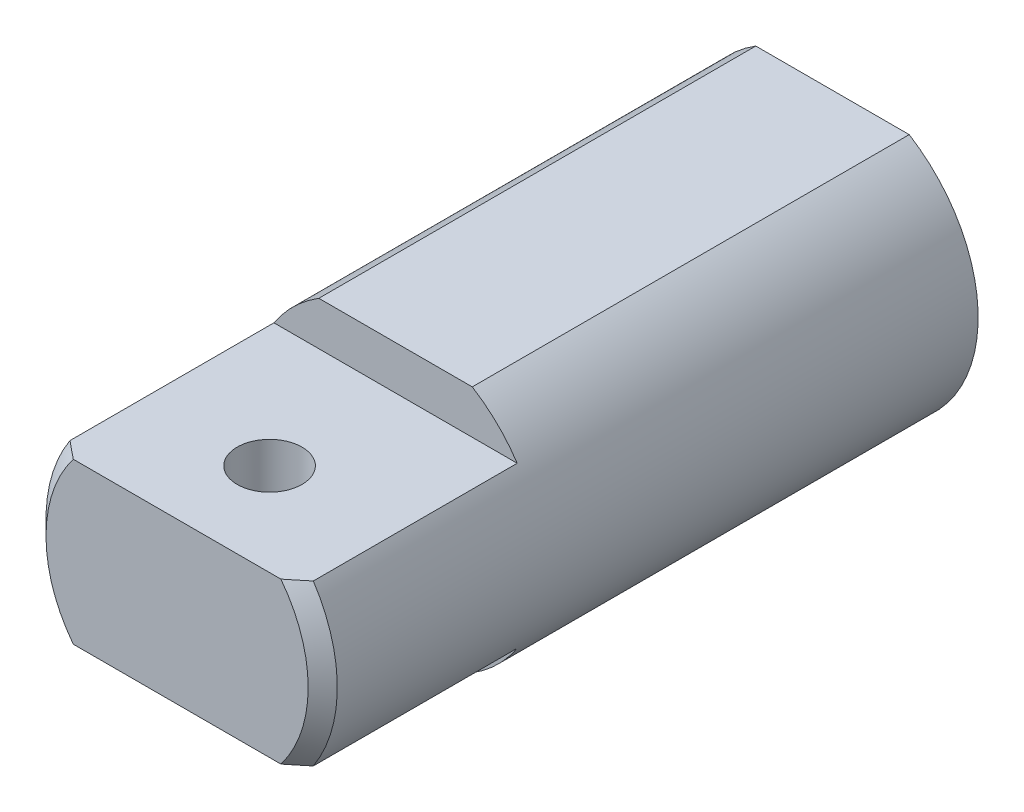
ISO-10303-21;
HEADER;
FILE_DESCRIPTION(('STEP AP214'),'2;1');
FILE_NAME('part.step','',(''),(''),'','','');
FILE_SCHEMA(('AUTOMOTIVE_DESIGN { 1 0 10303 214 1 1 1 1 }'));
ENDSEC;
DATA;
#1=APPLICATION_CONTEXT('core data for automotive mechanical design processes');
#2=APPLICATION_PROTOCOL_DEFINITION('international standard','automotive_design',2000,#1);
#3=PRODUCT_CONTEXT('',#1,'mechanical');
#4=PRODUCT('Part','Part','',(#3));
#5=PRODUCT_RELATED_PRODUCT_CATEGORY('part','',(#4));
#6=PRODUCT_DEFINITION_FORMATION('','',#4);
#7=PRODUCT_DEFINITION_CONTEXT('part definition',#1,'design');
#8=PRODUCT_DEFINITION('design','',#6,#7);
#9=PRODUCT_DEFINITION_SHAPE('','',#8);
#10=(LENGTH_UNIT() NAMED_UNIT(*) SI_UNIT(.MILLI.,.METRE.));
#11=(NAMED_UNIT(*) PLANE_ANGLE_UNIT() SI_UNIT($,.RADIAN.));
#12=(NAMED_UNIT(*) SI_UNIT($,.STERADIAN.) SOLID_ANGLE_UNIT());
#13=UNCERTAINTY_MEASURE_WITH_UNIT(LENGTH_MEASURE(1.E-05),#10,'distance_accuracy_value','');
#14=(GEOMETRIC_REPRESENTATION_CONTEXT(3) GLOBAL_UNCERTAINTY_ASSIGNED_CONTEXT((#13)) GLOBAL_UNIT_ASSIGNED_CONTEXT((#10,
#11,#12)) REPRESENTATION_CONTEXT('',''));
#15=CARTESIAN_POINT('',(0.,0.,0.));
#16=DIRECTION('',(0.,0.,1.));
#17=DIRECTION('',(1.,0.,0.));
#18=AXIS2_PLACEMENT_3D('',#15,#16,#17);
#19=CARTESIAN_POINT('',(308.084985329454,-199.999999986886,281.45));
#20=DIRECTION('',(0.,1.,0.));
#21=DIRECTION('',(1.,0.,0.));
#22=AXIS2_PLACEMENT_3D('',#19,#20,#21);
#23=CYLINDRICAL_SURFACE('',#22,2.22500000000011);
#24=CARTESIAN_POINT('',(308.084985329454,-205.499999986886,281.45));
#25=DIRECTION('',(0.,-1.,0.));
#26=DIRECTION('',(0.,0.,-1.));
#27=AXIS2_PLACEMENT_3D('',#24,#25,#26);
#28=CIRCLE('',#27,2.22500000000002);
#29=CARTESIAN_POINT('',(308.084985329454,-205.499999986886,279.225));
#30=VERTEX_POINT('',#29);
#31=EDGE_CURVE('E11',#30,#30,#28,.T.);
#32=ORIENTED_EDGE('',*,*,#31,.T.);
#33=EDGE_LOOP('',(#32));
#34=FACE_BOUND('',#33,.T.);
#35=CARTESIAN_POINT('',(308.084985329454,-194.499999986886,281.45));
#36=DIRECTION('',(0.,1.,0.));
#37=DIRECTION('',(1.,0.,0.));
#38=AXIS2_PLACEMENT_3D('',#35,#36,#37);
#39=CIRCLE('',#38,2.22500000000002);
#40=CARTESIAN_POINT('',(310.309985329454,-194.499999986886,281.45));
#41=VERTEX_POINT('',#40);
#42=EDGE_CURVE('E25',#41,#41,#39,.T.);
#43=ORIENTED_EDGE('',*,*,#42,.T.);
#44=EDGE_LOOP('',(#43));
#45=FACE_BOUND('',#44,.T.);
#46=ADVANCED_FACE('F16',(#34,#45),#23,.F.);
#47=CARTESIAN_POINT('',(308.084985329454,-199.999999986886,264.3));
#48=DIRECTION('',(0.,0.,-1.));
#49=DIRECTION('',(0.,-1.,0.));
#50=AXIS2_PLACEMENT_3D('',#47,#48,#49);
#51=CYLINDRICAL_SURFACE('',#50,4.18800000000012);
#52=CARTESIAN_POINT('',(308.084985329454,-199.999999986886,265.8));
#53=DIRECTION('',(0.,0.,-1.));
#54=DIRECTION('',(0.,-1.,0.));
#55=AXIS2_PLACEMENT_3D('',#52,#53,#54);
#56=CIRCLE('',#55,4.18799999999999);
#57=CARTESIAN_POINT('',(308.084985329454,-204.187999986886,265.8));
#58=VERTEX_POINT('',#57);
#59=EDGE_CURVE('E284',#58,#58,#56,.T.);
#60=ORIENTED_EDGE('',*,*,#59,.F.);
#61=EDGE_LOOP('',(#60));
#62=FACE_BOUND('',#61,.T.);
#63=CARTESIAN_POINT('',(308.084985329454,-199.999999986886,262.8));
#64=DIRECTION('',(0.,0.,-1.));
#65=DIRECTION('',(0.,-1.,0.));
#66=AXIS2_PLACEMENT_3D('',#63,#64,#65);
#67=CIRCLE('',#66,4.188);
#68=CARTESIAN_POINT('',(308.084985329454,-204.187999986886,262.8));
#69=VERTEX_POINT('',#68);
#70=EDGE_CURVE('E287',#69,#69,#67,.T.);
#71=ORIENTED_EDGE('',*,*,#70,.T.);
#72=EDGE_LOOP('',(#71));
#73=FACE_BOUND('',#72,.T.);
#74=ADVANCED_FACE('F313',(#62,#73),#51,.F.);
#75=CARTESIAN_POINT('',(308.084985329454,-199.999999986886,266.051640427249));
#76=DIRECTION('',(0.,0.,-1.));
#77=DIRECTION('',(1.,0.,0.));
#78=AXIS2_PLACEMENT_3D('',#75,#76,#77);
#79=CONICAL_SURFACE('',#78,3.76919999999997,1.02974425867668);
#80=CARTESIAN_POINT('',(308.084985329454,-199.999999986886,268.316404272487));
#81=VERTEX_POINT('',#80);
#82=VERTEX_LOOP('',#81);
#83=FACE_BOUND('',#82,.T.);
#84=ORIENTED_EDGE('',*,*,#59,.T.);
#85=EDGE_LOOP('',(#84));
#86=FACE_BOUND('',#85,.T.);
#87=ADVANCED_FACE('F319',(#83,#86),#79,.F.);
#88=CARTESIAN_POINT('',(308.084985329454,-199.999999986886,242.875));
#89=DIRECTION('',(0.,0.,-1.));
#90=DIRECTION('',(1.,0.,0.));
#91=AXIS2_PLACEMENT_3D('',#88,#89,#90);
#92=CONICAL_SURFACE('',#91,4.91879999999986,0.825070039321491);
#93=CARTESIAN_POINT('',(308.084985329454,-199.999999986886,243.55));
#94=DIRECTION('',(0.,0.,-1.));
#95=DIRECTION('',(0.,-1.,0.));
#96=AXIS2_PLACEMENT_3D('',#93,#94,#95);
#97=CIRCLE('',#96,4.18799999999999);
#98=CARTESIAN_POINT('',(308.084985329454,-204.187999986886,243.55));
#99=VERTEX_POINT('',#98);
#100=EDGE_CURVE('E275',#99,#99,#97,.T.);
#101=ORIENTED_EDGE('',*,*,#100,.F.);
#102=EDGE_LOOP('',(#101));
#103=FACE_BOUND('',#102,.T.);
#104=CARTESIAN_POINT('',(308.084985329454,-199.999999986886,242.8));
#105=DIRECTION('',(0.,0.,-1.));
#106=DIRECTION('',(0.,-1.,0.));
#107=AXIS2_PLACEMENT_3D('',#104,#105,#106);
#108=CIRCLE('',#107,5.);
#109=CARTESIAN_POINT('',(308.084985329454,-204.999999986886,242.8));
#110=VERTEX_POINT('',#109);
#111=EDGE_CURVE('E281',#110,#110,#108,.T.);
#112=ORIENTED_EDGE('',*,*,#111,.T.);
#113=EDGE_LOOP('',(#112));
#114=FACE_BOUND('',#113,.T.);
#115=ADVANCED_FACE('F329',(#103,#114),#92,.F.);
#116=CARTESIAN_POINT('',(308.084985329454,-199.999999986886,243.625));
#117=DIRECTION('',(0.,0.,1.));
#118=DIRECTION('',(1.,0.,0.));
#119=AXIS2_PLACEMENT_3D('',#116,#117,#118);
#120=CONICAL_SURFACE('',#119,4.26919999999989,0.825070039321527);
#121=CARTESIAN_POINT('',(308.084985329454,-199.999999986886,244.3));
#122=DIRECTION('',(0.,0.,1.));
#123=DIRECTION('',(1.,0.,0.));
#124=AXIS2_PLACEMENT_3D('',#121,#122,#123);
#125=CIRCLE('',#124,5.);
#126=CARTESIAN_POINT('',(313.084985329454,-199.999999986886,244.3));
#127=VERTEX_POINT('',#126);
#128=EDGE_CURVE('E278',#127,#127,#125,.T.);
#129=ORIENTED_EDGE('',*,*,#128,.T.);
#130=EDGE_LOOP('',(#129));
#131=FACE_BOUND('',#130,.T.);
#132=ORIENTED_EDGE('',*,*,#100,.T.);
#133=EDGE_LOOP('',(#132));
#134=FACE_BOUND('',#133,.T.);
#135=ADVANCED_FACE('F325',(#131,#134),#120,.F.);
#136=CARTESIAN_POINT('',(308.084985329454,-199.999999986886,244.375));
#137=DIRECTION('',(0.,0.,-1.));
#138=DIRECTION('',(1.,0.,0.));
#139=AXIS2_PLACEMENT_3D('',#136,#137,#138);
#140=CONICAL_SURFACE('',#139,4.91879999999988,0.825070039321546);
#141=CARTESIAN_POINT('',(308.084985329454,-199.999999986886,245.05));
#142=DIRECTION('',(0.,0.,-1.));
#143=DIRECTION('',(0.,-1.,0.));
#144=AXIS2_PLACEMENT_3D('',#141,#142,#143);
#145=CIRCLE('',#144,4.18799999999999);
#146=CARTESIAN_POINT('',(308.084985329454,-204.187999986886,245.05));
#147=VERTEX_POINT('',#146);
#148=EDGE_CURVE('E269',#147,#147,#145,.T.);
#149=ORIENTED_EDGE('',*,*,#148,.F.);
#150=EDGE_LOOP('',(#149));
#151=FACE_BOUND('',#150,.T.);
#152=ORIENTED_EDGE('',*,*,#128,.F.);
#153=EDGE_LOOP('',(#152));
#154=FACE_BOUND('',#153,.T.);
#155=ADVANCED_FACE('F328',(#151,#154),#140,.F.);
#156=CARTESIAN_POINT('',(308.084985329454,-199.999999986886,245.125));
#157=DIRECTION('',(0.,0.,1.));
#158=DIRECTION('',(1.,0.,0.));
#159=AXIS2_PLACEMENT_3D('',#156,#157,#158);
#160=CONICAL_SURFACE('',#159,4.26919999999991,0.825070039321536);
#161=CARTESIAN_POINT('',(308.084985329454,-199.999999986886,245.8));
#162=DIRECTION('',(0.,0.,1.));
#163=DIRECTION('',(1.,0.,0.));
#164=AXIS2_PLACEMENT_3D('',#161,#162,#163);
#165=CIRCLE('',#164,5.);
#166=CARTESIAN_POINT('',(313.084985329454,-199.999999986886,245.8));
#167=VERTEX_POINT('',#166);
#168=EDGE_CURVE('E272',#167,#167,#165,.T.);
#169=ORIENTED_EDGE('',*,*,#168,.T.);
#170=EDGE_LOOP('',(#169));
#171=FACE_BOUND('',#170,.T.);
#172=ORIENTED_EDGE('',*,*,#148,.T.);
#173=EDGE_LOOP('',(#172));
#174=FACE_BOUND('',#173,.T.);
#175=ADVANCED_FACE('F331',(#171,#174),#160,.F.);
#176=CARTESIAN_POINT('',(308.084985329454,-199.999999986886,245.875));
#177=DIRECTION('',(0.,0.,-1.));
#178=DIRECTION('',(1.,0.,0.));
#179=AXIS2_PLACEMENT_3D('',#176,#177,#178);
#180=CONICAL_SURFACE('',#179,4.91879999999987,0.825070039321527);
#181=CARTESIAN_POINT('',(308.084985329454,-199.999999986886,246.55));
#182=DIRECTION('',(0.,0.,-1.));
#183=DIRECTION('',(0.,-1.,0.));
#184=AXIS2_PLACEMENT_3D('',#181,#182,#183);
#185=CIRCLE('',#184,4.18799999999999);
#186=CARTESIAN_POINT('',(308.084985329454,-204.187999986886,246.55));
#187=VERTEX_POINT('',#186);
#188=EDGE_CURVE('E263',#187,#187,#185,.T.);
#189=ORIENTED_EDGE('',*,*,#188,.F.);
#190=EDGE_LOOP('',(#189));
#191=FACE_BOUND('',#190,.T.);
#192=ORIENTED_EDGE('',*,*,#168,.F.);
#193=EDGE_LOOP('',(#192));
#194=FACE_BOUND('',#193,.T.);
#195=ADVANCED_FACE('F334',(#191,#194),#180,.F.);
#196=CARTESIAN_POINT('',(308.084985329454,-199.999999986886,246.625));
#197=DIRECTION('',(0.,0.,1.));
#198=DIRECTION('',(1.,0.,0.));
#199=AXIS2_PLACEMENT_3D('',#196,#197,#198);
#200=CONICAL_SURFACE('',#199,4.26919999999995,0.82507003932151);
#201=CARTESIAN_POINT('',(308.084985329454,-199.999999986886,247.3));
#202=DIRECTION('',(0.,0.,1.));
#203=DIRECTION('',(1.,0.,0.));
#204=AXIS2_PLACEMENT_3D('',#201,#202,#203);
#205=CIRCLE('',#204,5.);
#206=CARTESIAN_POINT('',(313.084985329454,-199.999999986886,247.3));
#207=VERTEX_POINT('',#206);
#208=EDGE_CURVE('E266',#207,#207,#205,.T.);
#209=ORIENTED_EDGE('',*,*,#208,.T.);
#210=EDGE_LOOP('',(#209));
#211=FACE_BOUND('',#210,.T.);
#212=ORIENTED_EDGE('',*,*,#188,.T.);
#213=EDGE_LOOP('',(#212));
#214=FACE_BOUND('',#213,.T.);
#215=ADVANCED_FACE('F342',(#211,#214),#200,.F.);
#216=CARTESIAN_POINT('',(308.084985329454,-199.999999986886,247.375));
#217=DIRECTION('',(0.,0.,-1.));
#218=DIRECTION('',(1.,0.,0.));
#219=AXIS2_PLACEMENT_3D('',#216,#217,#218);
#220=CONICAL_SURFACE('',#219,4.91879999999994,0.825070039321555);
#221=CARTESIAN_POINT('',(308.084985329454,-199.999999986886,248.05));
#222=DIRECTION('',(0.,0.,-1.));
#223=DIRECTION('',(0.,-1.,0.));
#224=AXIS2_PLACEMENT_3D('',#221,#222,#223);
#225=CIRCLE('',#224,4.18799999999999);
#226=CARTESIAN_POINT('',(308.084985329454,-204.187999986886,248.05));
#227=VERTEX_POINT('',#226);
#228=EDGE_CURVE('E257',#227,#227,#225,.T.);
#229=ORIENTED_EDGE('',*,*,#228,.F.);
#230=EDGE_LOOP('',(#229));
#231=FACE_BOUND('',#230,.T.);
#232=ORIENTED_EDGE('',*,*,#208,.F.);
#233=EDGE_LOOP('',(#232));
#234=FACE_BOUND('',#233,.T.);
#235=ADVANCED_FACE('F345',(#231,#234),#220,.F.);
#236=CARTESIAN_POINT('',(308.084985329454,-199.999999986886,248.125));
#237=DIRECTION('',(0.,0.,1.));
#238=DIRECTION('',(1.,0.,0.));
#239=AXIS2_PLACEMENT_3D('',#236,#237,#238);
#240=CONICAL_SURFACE('',#239,4.2691999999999,0.825070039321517);
#241=CARTESIAN_POINT('',(308.084985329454,-199.999999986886,248.8));
#242=DIRECTION('',(0.,0.,1.));
#243=DIRECTION('',(1.,0.,0.));
#244=AXIS2_PLACEMENT_3D('',#241,#242,#243);
#245=CIRCLE('',#244,5.);
#246=CARTESIAN_POINT('',(313.084985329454,-199.999999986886,248.8));
#247=VERTEX_POINT('',#246);
#248=EDGE_CURVE('E260',#247,#247,#245,.T.);
#249=ORIENTED_EDGE('',*,*,#248,.T.);
#250=EDGE_LOOP('',(#249));
#251=FACE_BOUND('',#250,.T.);
#252=ORIENTED_EDGE('',*,*,#228,.T.);
#253=EDGE_LOOP('',(#252));
#254=FACE_BOUND('',#253,.T.);
#255=ADVANCED_FACE('F349',(#251,#254),#240,.F.);
#256=CARTESIAN_POINT('',(308.084985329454,-199.999999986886,248.875));
#257=DIRECTION('',(0.,0.,-1.));
#258=DIRECTION('',(1.,0.,0.));
#259=AXIS2_PLACEMENT_3D('',#256,#257,#258);
#260=CONICAL_SURFACE('',#259,4.9187999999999,0.825070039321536);
#261=CARTESIAN_POINT('',(308.084985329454,-199.999999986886,249.55));
#262=DIRECTION('',(0.,0.,-1.));
#263=DIRECTION('',(0.,-1.,0.));
#264=AXIS2_PLACEMENT_3D('',#261,#262,#263);
#265=CIRCLE('',#264,4.18799999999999);
#266=CARTESIAN_POINT('',(308.084985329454,-204.187999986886,249.55));
#267=VERTEX_POINT('',#266);
#268=EDGE_CURVE('E251',#267,#267,#265,.T.);
#269=ORIENTED_EDGE('',*,*,#268,.F.);
#270=EDGE_LOOP('',(#269));
#271=FACE_BOUND('',#270,.T.);
#272=ORIENTED_EDGE('',*,*,#248,.F.);
#273=EDGE_LOOP('',(#272));
#274=FACE_BOUND('',#273,.T.);
#275=ADVANCED_FACE('F353',(#271,#274),#260,.F.);
#276=CARTESIAN_POINT('',(308.084985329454,-199.999999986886,249.625));
#277=DIRECTION('',(0.,0.,1.));
#278=DIRECTION('',(1.,0.,0.));
#279=AXIS2_PLACEMENT_3D('',#276,#277,#278);
#280=CONICAL_SURFACE('',#279,4.26919999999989,0.825070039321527);
#281=CARTESIAN_POINT('',(308.084985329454,-199.999999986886,250.3));
#282=DIRECTION('',(0.,0.,1.));
#283=DIRECTION('',(1.,0.,0.));
#284=AXIS2_PLACEMENT_3D('',#281,#282,#283);
#285=CIRCLE('',#284,5.);
#286=CARTESIAN_POINT('',(313.084985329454,-199.999999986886,250.3));
#287=VERTEX_POINT('',#286);
#288=EDGE_CURVE('E254',#287,#287,#285,.T.);
#289=ORIENTED_EDGE('',*,*,#288,.T.);
#290=EDGE_LOOP('',(#289));
#291=FACE_BOUND('',#290,.T.);
#292=ORIENTED_EDGE('',*,*,#268,.T.);
#293=EDGE_LOOP('',(#292));
#294=FACE_BOUND('',#293,.T.);
#295=ADVANCED_FACE('F360',(#291,#294),#280,.F.);
#296=CARTESIAN_POINT('',(308.084985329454,-199.999999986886,250.375));
#297=DIRECTION('',(0.,0.,-1.));
#298=DIRECTION('',(1.,0.,0.));
#299=AXIS2_PLACEMENT_3D('',#296,#297,#298);
#300=CONICAL_SURFACE('',#299,4.91879999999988,0.825070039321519);
#301=CARTESIAN_POINT('',(308.084985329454,-199.999999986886,251.05));
#302=DIRECTION('',(0.,0.,-1.));
#303=DIRECTION('',(0.,-1.,0.));
#304=AXIS2_PLACEMENT_3D('',#301,#302,#303);
#305=CIRCLE('',#304,4.18799999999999);
#306=CARTESIAN_POINT('',(308.084985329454,-204.187999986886,251.05));
#307=VERTEX_POINT('',#306);
#308=EDGE_CURVE('E245',#307,#307,#305,.T.);
#309=ORIENTED_EDGE('',*,*,#308,.F.);
#310=EDGE_LOOP('',(#309));
#311=FACE_BOUND('',#310,.T.);
#312=ORIENTED_EDGE('',*,*,#288,.F.);
#313=EDGE_LOOP('',(#312));
#314=FACE_BOUND('',#313,.T.);
#315=ADVANCED_FACE('F364',(#311,#314),#300,.F.);
#316=CARTESIAN_POINT('',(308.084985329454,-199.999999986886,251.125));
#317=DIRECTION('',(0.,0.,1.));
#318=DIRECTION('',(1.,0.,0.));
#319=AXIS2_PLACEMENT_3D('',#316,#317,#318);
#320=CONICAL_SURFACE('',#319,4.26919999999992,0.825070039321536);
#321=CARTESIAN_POINT('',(308.084985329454,-199.999999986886,251.8));
#322=DIRECTION('',(0.,0.,1.));
#323=DIRECTION('',(1.,0.,0.));
#324=AXIS2_PLACEMENT_3D('',#321,#322,#323);
#325=CIRCLE('',#324,5.);
#326=CARTESIAN_POINT('',(313.084985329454,-199.999999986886,251.8));
#327=VERTEX_POINT('',#326);
#328=EDGE_CURVE('E248',#327,#327,#325,.T.);
#329=ORIENTED_EDGE('',*,*,#328,.T.);
#330=EDGE_LOOP('',(#329));
#331=FACE_BOUND('',#330,.T.);
#332=ORIENTED_EDGE('',*,*,#308,.T.);
#333=EDGE_LOOP('',(#332));
#334=FACE_BOUND('',#333,.T.);
#335=ADVANCED_FACE('F366',(#331,#334),#320,.F.);
#336=CARTESIAN_POINT('',(308.084985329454,-199.999999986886,251.875));
#337=DIRECTION('',(0.,0.,-1.));
#338=DIRECTION('',(1.,0.,0.));
#339=AXIS2_PLACEMENT_3D('',#336,#337,#338);
#340=CONICAL_SURFACE('',#339,4.91879999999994,0.825070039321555);
#341=CARTESIAN_POINT('',(308.084985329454,-199.999999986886,252.55));
#342=DIRECTION('',(0.,0.,-1.));
#343=DIRECTION('',(0.,-1.,0.));
#344=AXIS2_PLACEMENT_3D('',#341,#342,#343);
#345=CIRCLE('',#344,4.18799999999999);
#346=CARTESIAN_POINT('',(308.084985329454,-204.187999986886,252.55));
#347=VERTEX_POINT('',#346);
#348=EDGE_CURVE('E239',#347,#347,#345,.T.);
#349=ORIENTED_EDGE('',*,*,#348,.F.);
#350=EDGE_LOOP('',(#349));
#351=FACE_BOUND('',#350,.T.);
#352=ORIENTED_EDGE('',*,*,#328,.F.);
#353=EDGE_LOOP('',(#352));
#354=FACE_BOUND('',#353,.T.);
#355=ADVANCED_FACE('F369',(#351,#354),#340,.F.);
#356=CARTESIAN_POINT('',(308.084985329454,-199.999999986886,252.625));
#357=DIRECTION('',(0.,0.,1.));
#358=DIRECTION('',(1.,0.,0.));
#359=AXIS2_PLACEMENT_3D('',#356,#357,#358);
#360=CONICAL_SURFACE('',#359,4.26919999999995,0.825070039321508);
#361=CARTESIAN_POINT('',(308.084985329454,-199.999999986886,253.3));
#362=DIRECTION('',(0.,0.,1.));
#363=DIRECTION('',(1.,0.,0.));
#364=AXIS2_PLACEMENT_3D('',#361,#362,#363);
#365=CIRCLE('',#364,5.);
#366=CARTESIAN_POINT('',(313.084985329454,-199.999999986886,253.3));
#367=VERTEX_POINT('',#366);
#368=EDGE_CURVE('E242',#367,#367,#365,.T.);
#369=ORIENTED_EDGE('',*,*,#368,.T.);
#370=EDGE_LOOP('',(#369));
#371=FACE_BOUND('',#370,.T.);
#372=ORIENTED_EDGE('',*,*,#348,.T.);
#373=EDGE_LOOP('',(#372));
#374=FACE_BOUND('',#373,.T.);
#375=ADVANCED_FACE('F376',(#371,#374),#360,.F.);
#376=CARTESIAN_POINT('',(308.084985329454,-199.999999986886,253.375));
#377=DIRECTION('',(0.,0.,-1.));
#378=DIRECTION('',(1.,0.,0.));
#379=AXIS2_PLACEMENT_3D('',#376,#377,#378);
#380=CONICAL_SURFACE('',#379,4.91879999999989,0.825070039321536);
#381=CARTESIAN_POINT('',(308.084985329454,-199.999999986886,254.05));
#382=DIRECTION('',(0.,0.,-1.));
#383=DIRECTION('',(0.,-1.,0.));
#384=AXIS2_PLACEMENT_3D('',#381,#382,#383);
#385=CIRCLE('',#384,4.18799999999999);
#386=CARTESIAN_POINT('',(308.084985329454,-204.187999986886,254.05));
#387=VERTEX_POINT('',#386);
#388=EDGE_CURVE('E233',#387,#387,#385,.T.);
#389=ORIENTED_EDGE('',*,*,#388,.F.);
#390=EDGE_LOOP('',(#389));
#391=FACE_BOUND('',#390,.T.);
#392=ORIENTED_EDGE('',*,*,#368,.F.);
#393=EDGE_LOOP('',(#392));
#394=FACE_BOUND('',#393,.T.);
#395=ADVANCED_FACE('F380',(#391,#394),#380,.F.);
#396=CARTESIAN_POINT('',(308.084985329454,-199.999999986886,254.125));
#397=DIRECTION('',(0.,0.,1.));
#398=DIRECTION('',(1.,0.,0.));
#399=AXIS2_PLACEMENT_3D('',#396,#397,#398);
#400=CONICAL_SURFACE('',#399,4.26919999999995,0.82507003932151);
#401=CARTESIAN_POINT('',(308.084985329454,-199.999999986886,254.8));
#402=DIRECTION('',(0.,0.,1.));
#403=DIRECTION('',(1.,0.,0.));
#404=AXIS2_PLACEMENT_3D('',#401,#402,#403);
#405=CIRCLE('',#404,5.);
#406=CARTESIAN_POINT('',(313.084985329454,-199.999999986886,254.8));
#407=VERTEX_POINT('',#406);
#408=EDGE_CURVE('E236',#407,#407,#405,.T.);
#409=ORIENTED_EDGE('',*,*,#408,.T.);
#410=EDGE_LOOP('',(#409));
#411=FACE_BOUND('',#410,.T.);
#412=ORIENTED_EDGE('',*,*,#388,.T.);
#413=EDGE_LOOP('',(#412));
#414=FACE_BOUND('',#413,.T.);
#415=ADVANCED_FACE('F384',(#411,#414),#400,.F.);
#416=CARTESIAN_POINT('',(308.084985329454,-199.999999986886,254.875));
#417=DIRECTION('',(0.,0.,-1.));
#418=DIRECTION('',(1.,0.,0.));
#419=AXIS2_PLACEMENT_3D('',#416,#417,#418);
#420=CONICAL_SURFACE('',#419,4.91879999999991,0.825070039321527);
#421=CARTESIAN_POINT('',(308.084985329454,-199.999999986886,255.55));
#422=DIRECTION('',(0.,0.,-1.));
#423=DIRECTION('',(0.,-1.,0.));
#424=AXIS2_PLACEMENT_3D('',#421,#422,#423);
#425=CIRCLE('',#424,4.18799999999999);
#426=CARTESIAN_POINT('',(308.084985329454,-204.187999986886,255.55));
#427=VERTEX_POINT('',#426);
#428=EDGE_CURVE('E227',#427,#427,#425,.T.);
#429=ORIENTED_EDGE('',*,*,#428,.F.);
#430=EDGE_LOOP('',(#429));
#431=FACE_BOUND('',#430,.T.);
#432=ORIENTED_EDGE('',*,*,#408,.F.);
#433=EDGE_LOOP('',(#432));
#434=FACE_BOUND('',#433,.T.);
#435=ADVANCED_FACE('F388',(#431,#434),#420,.F.);
#436=CARTESIAN_POINT('',(308.084985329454,-199.999999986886,255.625));
#437=DIRECTION('',(0.,0.,1.));
#438=DIRECTION('',(1.,0.,0.));
#439=AXIS2_PLACEMENT_3D('',#436,#437,#438);
#440=CONICAL_SURFACE('',#439,4.26919999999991,0.825070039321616);
#441=CARTESIAN_POINT('',(308.084985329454,-199.999999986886,256.3));
#442=DIRECTION('',(0.,0.,1.));
#443=DIRECTION('',(1.,0.,0.));
#444=AXIS2_PLACEMENT_3D('',#441,#442,#443);
#445=CIRCLE('',#444,5.);
#446=CARTESIAN_POINT('',(313.084985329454,-199.999999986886,256.3));
#447=VERTEX_POINT('',#446);
#448=EDGE_CURVE('E230',#447,#447,#445,.T.);
#449=ORIENTED_EDGE('',*,*,#448,.T.);
#450=EDGE_LOOP('',(#449));
#451=FACE_BOUND('',#450,.T.);
#452=ORIENTED_EDGE('',*,*,#428,.T.);
#453=EDGE_LOOP('',(#452));
#454=FACE_BOUND('',#453,.T.);
#455=ADVANCED_FACE('F392',(#451,#454),#440,.F.);
#456=CARTESIAN_POINT('',(308.084985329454,-199.999999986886,256.375));
#457=DIRECTION('',(0.,0.,-1.));
#458=DIRECTION('',(1.,0.,0.));
#459=AXIS2_PLACEMENT_3D('',#456,#457,#458);
#460=CONICAL_SURFACE('',#459,4.91879999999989,0.825070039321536);
#461=CARTESIAN_POINT('',(308.084985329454,-199.999999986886,257.05));
#462=DIRECTION('',(0.,0.,-1.));
#463=DIRECTION('',(0.,-1.,0.));
#464=AXIS2_PLACEMENT_3D('',#461,#462,#463);
#465=CIRCLE('',#464,4.18799999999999);
#466=CARTESIAN_POINT('',(308.084985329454,-204.187999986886,257.05));
#467=VERTEX_POINT('',#466);
#468=EDGE_CURVE('E221',#467,#467,#465,.T.);
#469=ORIENTED_EDGE('',*,*,#468,.F.);
#470=EDGE_LOOP('',(#469));
#471=FACE_BOUND('',#470,.T.);
#472=ORIENTED_EDGE('',*,*,#448,.F.);
#473=EDGE_LOOP('',(#472));
#474=FACE_BOUND('',#473,.T.);
#475=ADVANCED_FACE('F396',(#471,#474),#460,.F.);
#476=CARTESIAN_POINT('',(308.084985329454,-199.999999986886,257.125));
#477=DIRECTION('',(0.,0.,1.));
#478=DIRECTION('',(1.,0.,0.));
#479=AXIS2_PLACEMENT_3D('',#476,#477,#478);
#480=CONICAL_SURFACE('',#479,4.26919999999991,0.825070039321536);
#481=CARTESIAN_POINT('',(308.084985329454,-199.999999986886,257.8));
#482=DIRECTION('',(0.,0.,1.));
#483=DIRECTION('',(1.,0.,0.));
#484=AXIS2_PLACEMENT_3D('',#481,#482,#483);
#485=CIRCLE('',#484,5.);
#486=CARTESIAN_POINT('',(313.084985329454,-199.999999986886,257.8));
#487=VERTEX_POINT('',#486);
#488=EDGE_CURVE('E224',#487,#487,#485,.T.);
#489=ORIENTED_EDGE('',*,*,#488,.T.);
#490=EDGE_LOOP('',(#489));
#491=FACE_BOUND('',#490,.T.);
#492=ORIENTED_EDGE('',*,*,#468,.T.);
#493=EDGE_LOOP('',(#492));
#494=FACE_BOUND('',#493,.T.);
#495=ADVANCED_FACE('F400',(#491,#494),#480,.F.);
#496=CARTESIAN_POINT('',(308.084985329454,-199.999999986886,257.875));
#497=DIRECTION('',(0.,0.,-1.));
#498=DIRECTION('',(1.,0.,0.));
#499=AXIS2_PLACEMENT_3D('',#496,#497,#498);
#500=CONICAL_SURFACE('',#499,4.91879999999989,0.825070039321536);
#501=CARTESIAN_POINT('',(308.084985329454,-199.999999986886,258.55));
#502=DIRECTION('',(0.,0.,-1.));
#503=DIRECTION('',(0.,-1.,0.));
#504=AXIS2_PLACEMENT_3D('',#501,#502,#503);
#505=CIRCLE('',#504,4.18799999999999);
#506=CARTESIAN_POINT('',(308.084985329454,-204.187999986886,258.55));
#507=VERTEX_POINT('',#506);
#508=EDGE_CURVE('E215',#507,#507,#505,.T.);
#509=ORIENTED_EDGE('',*,*,#508,.F.);
#510=EDGE_LOOP('',(#509));
#511=FACE_BOUND('',#510,.T.);
#512=ORIENTED_EDGE('',*,*,#488,.F.);
#513=EDGE_LOOP('',(#512));
#514=FACE_BOUND('',#513,.T.);
#515=ADVANCED_FACE('F404',(#511,#514),#500,.F.);
#516=CARTESIAN_POINT('',(308.084985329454,-199.999999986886,258.625));
#517=DIRECTION('',(0.,0.,1.));
#518=DIRECTION('',(1.,0.,0.));
#519=AXIS2_PLACEMENT_3D('',#516,#517,#518);
#520=CONICAL_SURFACE('',#519,4.26919999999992,0.82507003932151);
#521=CARTESIAN_POINT('',(308.084985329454,-199.999999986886,259.3));
#522=DIRECTION('',(0.,0.,1.));
#523=DIRECTION('',(1.,0.,0.));
#524=AXIS2_PLACEMENT_3D('',#521,#522,#523);
#525=CIRCLE('',#524,5.);
#526=CARTESIAN_POINT('',(313.084985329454,-199.999999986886,259.3));
#527=VERTEX_POINT('',#526);
#528=EDGE_CURVE('E218',#527,#527,#525,.T.);
#529=ORIENTED_EDGE('',*,*,#528,.T.);
#530=EDGE_LOOP('',(#529));
#531=FACE_BOUND('',#530,.T.);
#532=ORIENTED_EDGE('',*,*,#508,.T.);
#533=EDGE_LOOP('',(#532));
#534=FACE_BOUND('',#533,.T.);
#535=ADVANCED_FACE('F408',(#531,#534),#520,.F.);
#536=CARTESIAN_POINT('',(308.084985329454,-199.999999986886,259.375));
#537=DIRECTION('',(0.,0.,-1.));
#538=DIRECTION('',(1.,0.,0.));
#539=AXIS2_PLACEMENT_3D('',#536,#537,#538);
#540=CONICAL_SURFACE('',#539,4.91879999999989,0.825070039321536);
#541=CARTESIAN_POINT('',(308.084985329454,-199.999999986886,260.05));
#542=DIRECTION('',(0.,0.,-1.));
#543=DIRECTION('',(0.,-1.,0.));
#544=AXIS2_PLACEMENT_3D('',#541,#542,#543);
#545=CIRCLE('',#544,4.18799999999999);
#546=CARTESIAN_POINT('',(308.084985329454,-204.187999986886,260.05));
#547=VERTEX_POINT('',#546);
#548=EDGE_CURVE('E209',#547,#547,#545,.T.);
#549=ORIENTED_EDGE('',*,*,#548,.F.);
#550=EDGE_LOOP('',(#549));
#551=FACE_BOUND('',#550,.T.);
#552=ORIENTED_EDGE('',*,*,#528,.F.);
#553=EDGE_LOOP('',(#552));
#554=FACE_BOUND('',#553,.T.);
#555=ADVANCED_FACE('F412',(#551,#554),#540,.F.);
#556=CARTESIAN_POINT('',(308.084985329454,-199.999999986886,260.125));
#557=DIRECTION('',(0.,0.,1.));
#558=DIRECTION('',(1.,0.,0.));
#559=AXIS2_PLACEMENT_3D('',#556,#557,#558);
#560=CONICAL_SURFACE('',#559,4.26919999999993,0.825070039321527);
#561=CARTESIAN_POINT('',(308.084985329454,-199.999999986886,260.8));
#562=DIRECTION('',(0.,0.,1.));
#563=DIRECTION('',(1.,0.,0.));
#564=AXIS2_PLACEMENT_3D('',#561,#562,#563);
#565=CIRCLE('',#564,5.);
#566=CARTESIAN_POINT('',(313.084985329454,-199.999999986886,260.8));
#567=VERTEX_POINT('',#566);
#568=EDGE_CURVE('E212',#567,#567,#565,.T.);
#569=ORIENTED_EDGE('',*,*,#568,.T.);
#570=EDGE_LOOP('',(#569));
#571=FACE_BOUND('',#570,.T.);
#572=ORIENTED_EDGE('',*,*,#548,.T.);
#573=EDGE_LOOP('',(#572));
#574=FACE_BOUND('',#573,.T.);
#575=ADVANCED_FACE('F416',(#571,#574),#560,.F.);
#576=CARTESIAN_POINT('',(308.084985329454,-199.999999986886,260.875));
#577=DIRECTION('',(0.,0.,-1.));
#578=DIRECTION('',(1.,0.,0.));
#579=AXIS2_PLACEMENT_3D('',#576,#577,#578);
#580=CONICAL_SURFACE('',#579,4.91879999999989,0.825070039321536);
#581=CARTESIAN_POINT('',(308.084985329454,-199.999999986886,261.55));
#582=DIRECTION('',(0.,0.,-1.));
#583=DIRECTION('',(0.,-1.,0.));
#584=AXIS2_PLACEMENT_3D('',#581,#582,#583);
#585=CIRCLE('',#584,4.18799999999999);
#586=CARTESIAN_POINT('',(308.084985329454,-204.187999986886,261.55));
#587=VERTEX_POINT('',#586);
#588=EDGE_CURVE('E205',#587,#587,#585,.T.);
#589=ORIENTED_EDGE('',*,*,#588,.F.);
#590=EDGE_LOOP('',(#589));
#591=FACE_BOUND('',#590,.T.);
#592=ORIENTED_EDGE('',*,*,#568,.F.);
#593=EDGE_LOOP('',(#592));
#594=FACE_BOUND('',#593,.T.);
#595=ADVANCED_FACE('F420',(#591,#594),#580,.F.);
#596=CARTESIAN_POINT('',(308.084985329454,-199.999999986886,261.625));
#597=DIRECTION('',(0.,0.,1.));
#598=DIRECTION('',(1.,0.,0.));
#599=AXIS2_PLACEMENT_3D('',#596,#597,#598);
#600=CONICAL_SURFACE('',#599,4.26919999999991,0.825070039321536);
#601=CARTESIAN_POINT('',(308.084985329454,-199.999999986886,262.3));
#602=DIRECTION('',(0.,0.,1.));
#603=DIRECTION('',(1.,0.,0.));
#604=AXIS2_PLACEMENT_3D('',#601,#602,#603);
#605=CIRCLE('',#604,5.);
#606=CARTESIAN_POINT('',(313.084985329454,-199.999999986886,262.3));
#607=VERTEX_POINT('',#606);
#608=EDGE_CURVE('E206',#607,#607,#605,.T.);
#609=ORIENTED_EDGE('',*,*,#608,.T.);
#610=EDGE_LOOP('',(#609));
#611=FACE_BOUND('',#610,.T.);
#612=ORIENTED_EDGE('',*,*,#588,.T.);
#613=EDGE_LOOP('',(#612));
#614=FACE_BOUND('',#613,.T.);
#615=ADVANCED_FACE('F424',(#611,#614),#600,.F.);
#616=CARTESIAN_POINT('',(308.084985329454,-199.999999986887,262.35));
#617=DIRECTION('',(0.,0.,-1.));
#618=DIRECTION('',(1.,0.,0.));
#619=AXIS2_PLACEMENT_3D('',#616,#617,#618);
#620=CONICAL_SURFACE('',#619,4.94586666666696,0.8250700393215);
#621=CARTESIAN_POINT('',(308.084985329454,-199.999999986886,262.8));
#622=DIRECTION('',(0.,0.,1.));
#623=DIRECTION('',(1.,0.,0.));
#624=AXIS2_PLACEMENT_3D('',#621,#622,#623);
#625=CIRCLE('',#624,4.45866666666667);
#626=CARTESIAN_POINT('',(312.54365199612,-199.999999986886,262.8));
#627=VERTEX_POINT('',#626);
#628=EDGE_CURVE('E199',#627,#627,#625,.T.);
#629=ORIENTED_EDGE('',*,*,#628,.T.);
#630=EDGE_LOOP('',(#629));
#631=FACE_BOUND('',#630,.T.);
#632=ORIENTED_EDGE('',*,*,#608,.F.);
#633=EDGE_LOOP('',(#632));
#634=FACE_BOUND('',#633,.T.);
#635=ADVANCED_FACE('F428',(#631,#634),#620,.F.);
#636=CARTESIAN_POINT('',(308.084985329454,-199.999999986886,287.3));
#637=DIRECTION('',(0.,0.,-1.));
#638=DIRECTION('',(0.,-1.,0.));
#639=AXIS2_PLACEMENT_3D('',#636,#637,#638);
#640=CONICAL_SURFACE('',#639,9.5,0.785398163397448);
#641=CARTESIAN_POINT('',(299.733338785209,-205.499999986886,286.8));
#642=CARTESIAN_POINT('',(300.379519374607,-205.499999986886,287.339667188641));
#643=CARTESIAN_POINT('',(300.961081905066,-205.499999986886,287.8));
#644=(BOUNDED_CURVE() B_SPLINE_CURVE(2,(#641,#642,#643),.UNSPECIFIED.,.F.,
.F.) B_SPLINE_CURVE_WITH_KNOTS((3,3),(19.5390359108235,22.1106304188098),
.UNSPECIFIED.) CURVE() GEOMETRIC_REPRESENTATION_ITEM() RATIONAL_B_SPLINE_CURVE((1.03056041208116,
1.0172912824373,1.)) REPRESENTATION_ITEM(''));
#645=CARTESIAN_POINT('',(299.733338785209,-205.499999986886,286.8));
#646=VERTEX_POINT('',#645);
#647=CARTESIAN_POINT('',(300.961081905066,-205.499999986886,287.8));
#648=VERTEX_POINT('',#647);
#649=EDGE_CURVE('E195',#646,#648,#644,.T.);
#650=ORIENTED_EDGE('',*,*,#649,.T.);
#651=CARTESIAN_POINT('',(308.084985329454,-199.999999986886,287.8));
#652=DIRECTION('',(0.,0.,-1.));
#653=DIRECTION('',(0.,-1.,0.));
#654=AXIS2_PLACEMENT_3D('',#651,#652,#653);
#655=CIRCLE('',#654,9.);
#656=CARTESIAN_POINT('',(300.961081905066,-194.499999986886,287.8));
#657=VERTEX_POINT('',#656);
#658=EDGE_CURVE('E37',#648,#657,#655,.T.);
#659=ORIENTED_EDGE('',*,*,#658,.T.);
#660=CARTESIAN_POINT('',(300.961081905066,-194.499999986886,287.8));
#661=CARTESIAN_POINT('',(300.379519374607,-194.499999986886,287.339667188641));
#662=CARTESIAN_POINT('',(299.733338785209,-194.499999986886,286.8));
#663=(BOUNDED_CURVE() B_SPLINE_CURVE(2,(#660,#661,#662),.UNSPECIFIED.,.F.,
.F.) B_SPLINE_CURVE_WITH_KNOTS((3,3),(0.,2.57159450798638),
.UNSPECIFIED.) CURVE() GEOMETRIC_REPRESENTATION_ITEM() RATIONAL_B_SPLINE_CURVE((1.,
1.0172912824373,1.03056041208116)) REPRESENTATION_ITEM(''));
#664=CARTESIAN_POINT('',(299.733338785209,-194.499999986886,286.8));
#665=VERTEX_POINT('',#664);
#666=EDGE_CURVE('E186',#657,#665,#663,.T.);
#667=ORIENTED_EDGE('',*,*,#666,.T.);
#668=CARTESIAN_POINT('',(308.084985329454,-199.999999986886,286.8));
#669=DIRECTION('',(0.,0.,1.));
#670=DIRECTION('',(1.,0.,0.));
#671=AXIS2_PLACEMENT_3D('',#668,#669,#670);
#672=CIRCLE('',#671,10.);
#673=EDGE_CURVE('E180',#665,#646,#672,.T.);
#674=ORIENTED_EDGE('',*,*,#673,.T.);
#675=EDGE_LOOP('',(#650,#659,#667,#674));
#676=FACE_BOUND('',#675,.T.);
#677=ADVANCED_FACE('F308',(#676),#640,.T.);
#678=CARTESIAN_POINT('',(308.084985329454,-199.999999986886,264.8));
#679=DIRECTION('',(0.,0.,-1.));
#680=DIRECTION('',(0.,-1.,0.));
#681=AXIS2_PLACEMENT_3D('',#678,#679,#680);
#682=CYLINDRICAL_SURFACE('',#681,10.);
#683=ORIENTED_EDGE('',*,*,#673,.F.);
#684=DIRECTION('',(0.,0.,1.));
#685=VECTOR('',#684,1.);
#686=CARTESIAN_POINT('',(299.733338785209,-194.499999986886,272.8));
#687=LINE('',#686,#685);
#688=CARTESIAN_POINT('',(299.733338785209,-194.499999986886,272.8));
#689=VERTEX_POINT('',#688);
#690=EDGE_CURVE('E166',#689,#665,#687,.T.);
#691=ORIENTED_EDGE('',*,*,#690,.F.);
#692=CARTESIAN_POINT('',(308.084985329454,-199.999999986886,272.8));
#693=DIRECTION('',(0.,0.,1.));
#694=DIRECTION('',(0.,-1.,0.));
#695=AXIS2_PLACEMENT_3D('',#692,#693,#694);
#696=CIRCLE('',#695,10.);
#697=CARTESIAN_POINT('',(302.817158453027,-191.499999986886,272.8));
#698=VERTEX_POINT('',#697);
#699=EDGE_CURVE('E122',#698,#689,#696,.T.);
#700=ORIENTED_EDGE('',*,*,#699,.F.);
#701=DIRECTION('',(0.,0.,-1.));
#702=VECTOR('',#701,1.);
#703=CARTESIAN_POINT('',(302.817158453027,-191.499999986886,272.8));
#704=LINE('',#703,#702);
#705=CARTESIAN_POINT('',(302.817158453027,-191.499999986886,242.8));
#706=VERTEX_POINT('',#705);
#707=EDGE_CURVE('E121',#698,#706,#704,.T.);
#708=ORIENTED_EDGE('',*,*,#707,.T.);
#709=CARTESIAN_POINT('',(308.084985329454,-199.999999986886,242.8));
#710=DIRECTION('',(0.,0.,-1.));
#711=DIRECTION('',(1.,0.,0.));
#712=AXIS2_PLACEMENT_3D('',#709,#710,#711);
#713=CIRCLE('',#712,10.);
#714=CARTESIAN_POINT('',(302.817158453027,-208.499999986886,242.8));
#715=VERTEX_POINT('',#714);
#716=EDGE_CURVE('E128',#715,#706,#713,.T.);
#717=ORIENTED_EDGE('',*,*,#716,.F.);
#718=DIRECTION('',(0.,0.,-1.));
#719=VECTOR('',#718,1.);
#720=CARTESIAN_POINT('',(302.817158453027,-208.499999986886,272.8));
#721=LINE('',#720,#719);
#722=CARTESIAN_POINT('',(302.817158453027,-208.499999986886,272.8));
#723=VERTEX_POINT('',#722);
#724=EDGE_CURVE('E137',#723,#715,#721,.T.);
#725=ORIENTED_EDGE('',*,*,#724,.F.);
#726=CARTESIAN_POINT('',(308.084985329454,-199.999999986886,272.8));
#727=DIRECTION('',(0.,0.,1.));
#728=DIRECTION('',(0.,-1.,0.));
#729=AXIS2_PLACEMENT_3D('',#726,#727,#728);
#730=CIRCLE('',#729,10.);
#731=CARTESIAN_POINT('',(299.733338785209,-205.499999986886,272.8));
#732=VERTEX_POINT('',#731);
#733=EDGE_CURVE('E145',#732,#723,#730,.T.);
#734=ORIENTED_EDGE('',*,*,#733,.F.);
#735=DIRECTION('',(0.,0.,-1.));
#736=VECTOR('',#735,1.);
#737=CARTESIAN_POINT('',(299.733338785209,-205.499999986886,286.8));
#738=LINE('',#737,#736);
#739=EDGE_CURVE('E106',#646,#732,#738,.T.);
#740=ORIENTED_EDGE('',*,*,#739,.F.);
#741=EDGE_LOOP('',(#683,#691,#700,#708,#717,#725,#734,#740));
#742=FACE_BOUND('',#741,.T.);
#743=ADVANCED_FACE('F299',(#742),#682,.T.);
#744=CARTESIAN_POINT('',(299.733338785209,-194.499999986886,280.3));
#745=DIRECTION('',(0.,-1.,0.));
#746=DIRECTION('',(0.,0.,-1.));
#747=AXIS2_PLACEMENT_3D('',#744,#745,#746);
#748=PLANE('',#747);
#749=ORIENTED_EDGE('',*,*,#666,.F.);
#750=DIRECTION('',(1.,0.,0.));
#751=VECTOR('',#750,1.);
#752=CARTESIAN_POINT('',(300.961081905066,-194.499999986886,287.8));
#753=LINE('',#752,#751);
#754=CARTESIAN_POINT('',(315.208888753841,-194.499999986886,287.8));
#755=VERTEX_POINT('',#754);
#756=EDGE_CURVE('E165',#657,#755,#753,.T.);
#757=ORIENTED_EDGE('',*,*,#756,.T.);
#758=CARTESIAN_POINT('',(316.436631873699,-194.499999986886,286.8));
#759=CARTESIAN_POINT('',(315.7904512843,-194.499999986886,287.339667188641));
#760=CARTESIAN_POINT('',(315.208888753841,-194.499999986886,287.8));
#761=(BOUNDED_CURVE() B_SPLINE_CURVE(2,(#758,#759,#760),.UNSPECIFIED.,.F.,
.F.) B_SPLINE_CURVE_WITH_KNOTS((3,3),(19.5390359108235,22.1106304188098),
.UNSPECIFIED.) CURVE() GEOMETRIC_REPRESENTATION_ITEM() RATIONAL_B_SPLINE_CURVE((1.03056041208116,
1.0172912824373,1.)) REPRESENTATION_ITEM(''));
#762=CARTESIAN_POINT('',(316.436631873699,-194.499999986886,286.8));
#763=VERTEX_POINT('',#762);
#764=EDGE_CURVE('E161',#763,#755,#761,.T.);
#765=ORIENTED_EDGE('',*,*,#764,.F.);
#766=DIRECTION('',(0.,0.,-1.));
#767=VECTOR('',#766,1.);
#768=CARTESIAN_POINT('',(316.436631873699,-194.499999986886,286.8));
#769=LINE('',#768,#767);
#770=CARTESIAN_POINT('',(316.436631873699,-194.499999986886,272.8));
#771=VERTEX_POINT('',#770);
#772=EDGE_CURVE('E163',#763,#771,#769,.T.);
#773=ORIENTED_EDGE('',*,*,#772,.T.);
#774=DIRECTION('',(1.,0.,0.));
#775=VECTOR('',#774,1.);
#776=CARTESIAN_POINT('',(299.733338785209,-194.499999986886,272.8));
#777=LINE('',#776,#775);
#778=EDGE_CURVE('E102',#689,#771,#777,.T.);
#779=ORIENTED_EDGE('',*,*,#778,.F.);
#780=ORIENTED_EDGE('',*,*,#690,.T.);
#781=EDGE_LOOP('',(#749,#757,#765,#773,#779,#780));
#782=FACE_BOUND('',#781,.T.);
#783=ORIENTED_EDGE('',*,*,#42,.F.);
#784=EDGE_LOOP('',(#783));
#785=FACE_BOUND('',#784,.T.);
#786=ADVANCED_FACE('F296',(#782,#785),#748,.F.);
#787=CARTESIAN_POINT('',(308.084985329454,-199.999999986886,287.3));
#788=DIRECTION('',(0.,0.,-1.));
#789=DIRECTION('',(0.,-1.,0.));
#790=AXIS2_PLACEMENT_3D('',#787,#788,#789);
#791=CONICAL_SURFACE('',#790,9.5,0.785398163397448);
#792=ORIENTED_EDGE('',*,*,#764,.T.);
#793=CARTESIAN_POINT('',(308.084985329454,-199.999999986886,287.8));
#794=DIRECTION('',(0.,0.,-1.));
#795=DIRECTION('',(0.,-1.,0.));
#796=AXIS2_PLACEMENT_3D('',#793,#794,#795);
#797=CIRCLE('',#796,9.);
#798=CARTESIAN_POINT('',(315.208888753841,-205.499999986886,287.8));
#799=VERTEX_POINT('',#798);
#800=EDGE_CURVE('E155',#755,#799,#797,.T.);
#801=ORIENTED_EDGE('',*,*,#800,.T.);
#802=CARTESIAN_POINT('',(315.208888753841,-205.499999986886,287.8));
#803=CARTESIAN_POINT('',(315.7904512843,-205.499999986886,287.339667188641));
#804=CARTESIAN_POINT('',(316.436631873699,-205.499999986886,286.8));
#805=(BOUNDED_CURVE() B_SPLINE_CURVE(2,(#802,#803,#804),.UNSPECIFIED.,.F.,
.F.) B_SPLINE_CURVE_WITH_KNOTS((3,3),(0.,2.57159450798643),
.UNSPECIFIED.) CURVE() GEOMETRIC_REPRESENTATION_ITEM() RATIONAL_B_SPLINE_CURVE((1.,
1.0172912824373,1.03056041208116)) REPRESENTATION_ITEM(''));
#806=CARTESIAN_POINT('',(316.436631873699,-205.499999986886,286.8));
#807=VERTEX_POINT('',#806);
#808=EDGE_CURVE('E150',#799,#807,#805,.T.);
#809=ORIENTED_EDGE('',*,*,#808,.T.);
#810=CARTESIAN_POINT('',(308.084985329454,-199.999999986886,286.8));
#811=DIRECTION('',(0.,0.,1.));
#812=DIRECTION('',(1.,0.,0.));
#813=AXIS2_PLACEMENT_3D('',#810,#811,#812);
#814=CIRCLE('',#813,10.);
#815=EDGE_CURVE('E115',#807,#763,#814,.T.);
#816=ORIENTED_EDGE('',*,*,#815,.T.);
#817=EDGE_LOOP('',(#792,#801,#809,#816));
#818=FACE_BOUND('',#817,.T.);
#819=ADVANCED_FACE('F298',(#818),#791,.T.);
#820=CARTESIAN_POINT('',(308.084985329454,-199.999999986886,264.8));
#821=DIRECTION('',(0.,0.,-1.));
#822=DIRECTION('',(0.,-1.,0.));
#823=AXIS2_PLACEMENT_3D('',#820,#821,#822);
#824=CYLINDRICAL_SURFACE('',#823,10.);
#825=ORIENTED_EDGE('',*,*,#815,.F.);
#826=DIRECTION('',(0.,0.,1.));
#827=VECTOR('',#826,1.);
#828=CARTESIAN_POINT('',(316.436631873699,-205.499999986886,272.8));
#829=LINE('',#828,#827);
#830=CARTESIAN_POINT('',(316.436631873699,-205.499999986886,272.8));
#831=VERTEX_POINT('',#830);
#832=EDGE_CURVE('E132',#831,#807,#829,.T.);
#833=ORIENTED_EDGE('',*,*,#832,.F.);
#834=CARTESIAN_POINT('',(308.084985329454,-199.999999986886,272.8));
#835=DIRECTION('',(0.,0.,1.));
#836=DIRECTION('',(0.,-1.,0.));
#837=AXIS2_PLACEMENT_3D('',#834,#835,#836);
#838=CIRCLE('',#837,10.);
#839=CARTESIAN_POINT('',(313.35281220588,-208.499999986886,272.8));
#840=VERTEX_POINT('',#839);
#841=EDGE_CURVE('E142',#840,#831,#838,.T.);
#842=ORIENTED_EDGE('',*,*,#841,.F.);
#843=DIRECTION('',(0.,0.,1.));
#844=VECTOR('',#843,1.);
#845=CARTESIAN_POINT('',(313.35281220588,-208.499999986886,242.8));
#846=LINE('',#845,#844);
#847=CARTESIAN_POINT('',(313.35281220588,-208.499999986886,242.8));
#848=VERTEX_POINT('',#847);
#849=EDGE_CURVE('E136',#848,#840,#846,.T.);
#850=ORIENTED_EDGE('',*,*,#849,.F.);
#851=CARTESIAN_POINT('',(308.084985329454,-199.999999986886,242.8));
#852=DIRECTION('',(0.,0.,-1.));
#853=DIRECTION('',(1.,0.,0.));
#854=AXIS2_PLACEMENT_3D('',#851,#852,#853);
#855=CIRCLE('',#854,10.);
#856=CARTESIAN_POINT('',(313.35281220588,-191.499999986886,242.8));
#857=VERTEX_POINT('',#856);
#858=EDGE_CURVE('E111',#857,#848,#855,.T.);
#859=ORIENTED_EDGE('',*,*,#858,.F.);
#860=DIRECTION('',(0.,0.,1.));
#861=VECTOR('',#860,1.);
#862=CARTESIAN_POINT('',(313.35281220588,-191.499999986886,242.8));
#863=LINE('',#862,#861);
#864=CARTESIAN_POINT('',(313.35281220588,-191.499999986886,272.8));
#865=VERTEX_POINT('',#864);
#866=EDGE_CURVE('E109',#857,#865,#863,.T.);
#867=ORIENTED_EDGE('',*,*,#866,.T.);
#868=CARTESIAN_POINT('',(308.084985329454,-199.999999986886,272.8));
#869=DIRECTION('',(0.,0.,1.));
#870=DIRECTION('',(0.,-1.,0.));
#871=AXIS2_PLACEMENT_3D('',#868,#869,#870);
#872=CIRCLE('',#871,10.);
#873=EDGE_CURVE('E96',#771,#865,#872,.T.);
#874=ORIENTED_EDGE('',*,*,#873,.F.);
#875=ORIENTED_EDGE('',*,*,#772,.F.);
#876=EDGE_LOOP('',(#825,#833,#842,#850,#859,#867,#874,#875));
#877=FACE_BOUND('',#876,.T.);
#878=ADVANCED_FACE('F18',(#877),#824,.T.);
#879=CARTESIAN_POINT('',(308.084985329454,-208.499999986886,265.3));
#880=DIRECTION('',(0.,1.,0.));
#881=DIRECTION('',(0.,0.,1.));
#882=AXIS2_PLACEMENT_3D('',#879,#880,#881);
#883=PLANE('',#882);
#884=DIRECTION('',(1.,0.,0.));
#885=VECTOR('',#884,1.);
#886=CARTESIAN_POINT('',(302.817158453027,-208.499999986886,242.8));
#887=LINE('',#886,#885);
#888=EDGE_CURVE('E116',#715,#848,#887,.T.);
#889=ORIENTED_EDGE('',*,*,#888,.T.);
#890=ORIENTED_EDGE('',*,*,#849,.T.);
#891=DIRECTION('',(-1.,0.,0.));
#892=VECTOR('',#891,1.);
#893=CARTESIAN_POINT('',(313.35281220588,-208.499999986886,272.8));
#894=LINE('',#893,#892);
#895=EDGE_CURVE('E133',#840,#723,#894,.T.);
#896=ORIENTED_EDGE('',*,*,#895,.T.);
#897=ORIENTED_EDGE('',*,*,#724,.T.);
#898=EDGE_LOOP('',(#889,#890,#896,#897));
#899=FACE_BOUND('',#898,.T.);
#900=ADVANCED_FACE('F453',(#899),#883,.F.);
#901=CARTESIAN_POINT('',(299.028764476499,-205.499999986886,272.8));
#902=DIRECTION('',(0.,0.,-1.));
#903=DIRECTION('',(-1.,0.,0.));
#904=AXIS2_PLACEMENT_3D('',#901,#902,#903);
#905=PLANE('',#904);
#906=ORIENTED_EDGE('',*,*,#895,.F.);
#907=ORIENTED_EDGE('',*,*,#841,.T.);
#908=DIRECTION('',(1.,0.,0.));
#909=VECTOR('',#908,1.);
#910=CARTESIAN_POINT('',(299.733338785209,-205.499999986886,272.8));
#911=LINE('',#910,#909);
#912=EDGE_CURVE('E129',#732,#831,#911,.T.);
#913=ORIENTED_EDGE('',*,*,#912,.F.);
#914=ORIENTED_EDGE('',*,*,#733,.T.);
#915=EDGE_LOOP('',(#906,#907,#913,#914));
#916=FACE_BOUND('',#915,.T.);
#917=ADVANCED_FACE('F451',(#916),#905,.F.);
#918=CARTESIAN_POINT('',(308.084985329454,-191.499999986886,242.8));
#919=DIRECTION('',(0.,-1.,0.));
#920=DIRECTION('',(0.,0.,-1.));
#921=AXIS2_PLACEMENT_3D('',#918,#919,#920);
#922=PLANE('',#921);
#923=DIRECTION('',(1.,0.,0.));
#924=VECTOR('',#923,1.);
#925=CARTESIAN_POINT('',(302.817158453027,-191.499999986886,242.8));
#926=LINE('',#925,#924);
#927=EDGE_CURVE('E123',#706,#857,#926,.T.);
#928=ORIENTED_EDGE('',*,*,#927,.F.);
#929=ORIENTED_EDGE('',*,*,#707,.F.);
#930=DIRECTION('',(-1.,0.,0.));
#931=VECTOR('',#930,1.);
#932=CARTESIAN_POINT('',(313.35281220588,-191.499999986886,272.8));
#933=LINE('',#932,#931);
#934=EDGE_CURVE('E100',#865,#698,#933,.T.);
#935=ORIENTED_EDGE('',*,*,#934,.F.);
#936=ORIENTED_EDGE('',*,*,#866,.F.);
#937=EDGE_LOOP('',(#928,#929,#935,#936));
#938=FACE_BOUND('',#937,.T.);
#939=ADVANCED_FACE('F119',(#938),#922,.F.);
#940=CARTESIAN_POINT('',(298.084985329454,-199.999999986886,242.8));
#941=DIRECTION('',(0.,0.,1.));
#942=DIRECTION('',(1.,0.,0.));
#943=AXIS2_PLACEMENT_3D('',#940,#941,#942);
#944=PLANE('',#943);
#945=ORIENTED_EDGE('',*,*,#888,.F.);
#946=ORIENTED_EDGE('',*,*,#716,.T.);
#947=ORIENTED_EDGE('',*,*,#927,.T.);
#948=ORIENTED_EDGE('',*,*,#858,.T.);
#949=EDGE_LOOP('',(#945,#946,#947,#948));
#950=FACE_BOUND('',#949,.T.);
#951=ORIENTED_EDGE('',*,*,#111,.F.);
#952=EDGE_LOOP('',(#951));
#953=FACE_BOUND('',#952,.T.);
#954=ADVANCED_FACE('F456',(#950,#953),#944,.F.);
#955=CARTESIAN_POINT('',(299.733338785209,-192.999999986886,272.8));
#956=DIRECTION('',(0.,0.,-1.));
#957=DIRECTION('',(-1.,0.,0.));
#958=AXIS2_PLACEMENT_3D('',#955,#956,#957);
#959=PLANE('',#958);
#960=ORIENTED_EDGE('',*,*,#934,.T.);
#961=ORIENTED_EDGE('',*,*,#699,.T.);
#962=ORIENTED_EDGE('',*,*,#778,.T.);
#963=ORIENTED_EDGE('',*,*,#873,.T.);
#964=EDGE_LOOP('',(#960,#961,#962,#963));
#965=FACE_BOUND('',#964,.T.);
#966=ADVANCED_FACE('F98',(#965),#959,.F.);
#967=CARTESIAN_POINT('',(308.084985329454,-204.458666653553,262.8));
#968=DIRECTION('',(0.,0.,1.));
#969=DIRECTION('',(1.,0.,0.));
#970=AXIS2_PLACEMENT_3D('',#967,#968,#969);
#971=PLANE('',#970);
#972=ORIENTED_EDGE('',*,*,#628,.F.);
#973=EDGE_LOOP('',(#972));
#974=FACE_BOUND('',#973,.T.);
#975=ORIENTED_EDGE('',*,*,#70,.F.);
#976=EDGE_LOOP('',(#975));
#977=FACE_BOUND('',#976,.T.);
#978=ADVANCED_FACE('F466',(#974,#977),#971,.F.);
#979=CARTESIAN_POINT('',(299.028764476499,-205.499999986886,292.8));
#980=DIRECTION('',(0.,1.,0.));
#981=DIRECTION('',(0.,0.,1.));
#982=AXIS2_PLACEMENT_3D('',#979,#980,#981);
#983=PLANE('',#982);
#984=ORIENTED_EDGE('',*,*,#649,.F.);
#985=ORIENTED_EDGE('',*,*,#739,.T.);
#986=ORIENTED_EDGE('',*,*,#912,.T.);
#987=ORIENTED_EDGE('',*,*,#832,.T.);
#988=ORIENTED_EDGE('',*,*,#808,.F.);
#989=DIRECTION('',(-1.,0.,0.));
#990=VECTOR('',#989,1.);
#991=CARTESIAN_POINT('',(315.208888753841,-205.499999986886,287.8));
#992=LINE('',#991,#990);
#993=EDGE_CURVE('E20',#799,#648,#992,.T.);
#994=ORIENTED_EDGE('',*,*,#993,.T.);
#995=EDGE_LOOP('',(#984,#985,#986,#987,#988,#994));
#996=FACE_BOUND('',#995,.T.);
#997=ORIENTED_EDGE('',*,*,#31,.F.);
#998=EDGE_LOOP('',(#997));
#999=FACE_BOUND('',#998,.T.);
#1000=ADVANCED_FACE('F441',(#996,#999),#983,.F.);
#1001=CARTESIAN_POINT('',(299.084985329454,-199.999999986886,287.8));
#1002=DIRECTION('',(0.,0.,1.));
#1003=DIRECTION('',(1.,0.,0.));
#1004=AXIS2_PLACEMENT_3D('',#1001,#1002,#1003);
#1005=PLANE('',#1004);
#1006=ORIENTED_EDGE('',*,*,#658,.F.);
#1007=ORIENTED_EDGE('',*,*,#993,.F.);
#1008=ORIENTED_EDGE('',*,*,#800,.F.);
#1009=ORIENTED_EDGE('',*,*,#756,.F.);
#1010=EDGE_LOOP('',(#1006,#1007,#1008,#1009));
#1011=FACE_BOUND('',#1010,.T.);
#1012=ADVANCED_FACE('F444',(#1011),#1005,.T.);
#1013=CLOSED_SHELL('',(#46,#74,#87,#115,#135,#155,#175,#195,#215,#235,#255,#275,#295,#315,#335,
#355,#375,#395,#415,#435,#455,#475,#495,#515,#535,#555,#575,#595,#615,#635,#677,#743,#786,#819,
#878,#900,#917,#939,#954,#966,#978,#1000,#1012));
#1014=MANIFOLD_SOLID_BREP('B1',#1013);
#1015=ADVANCED_BREP_SHAPE_REPRESENTATION('',(#18,#1014),#14);
#1016=SHAPE_DEFINITION_REPRESENTATION(#9,#1015);
ENDSEC;
END-ISO-10303-21;
